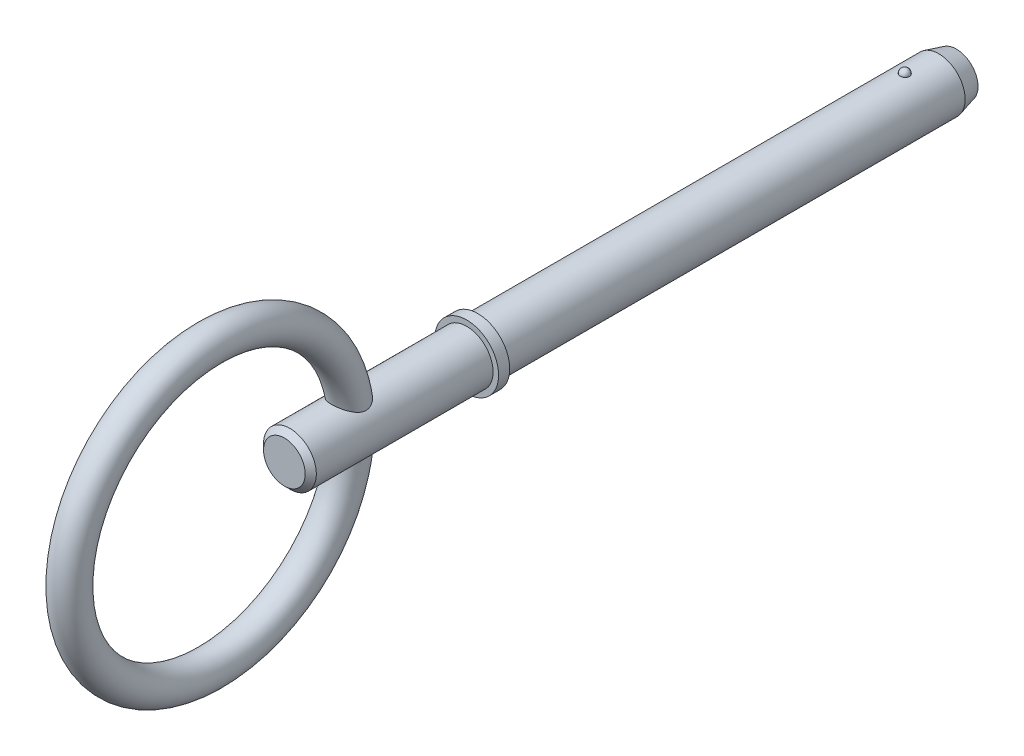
from build123d import *

# Parameters (mm, degrees)
SKETCH2_R           = 2.38
BOSS_EXTRUDE1_DEPTH = 38.1
BOSS_EXTRUDE2_START = 5.08
SKETCH3_R           = 2.38
BOSS_EXTRUDE2_DEPTH = 5.08
CHAMFER1_SIZE       = 1.586
CHAMFER1_SIZE2      = 0.424967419
SKETCH20_W          = 1
SKETCH20_H          = 2.88
SKETCH21_R          = 2.38
BOSS_EXTRUDE3_DEPTH = 17.45
CHAMFER2_SIZE       = 0.5
SKETCH24_R          = 1.5


with BuildPart() as part:
    # Sketch2 → Boss-Extrude1 (new body)
    with BuildSketch(Plane.XY):
        with Locations(Location((0, 0, 0), (0, 0, 180))):
            Circle(SKETCH2_R)
    extrude(amount=BOSS_EXTRUDE1_DEPTH)

    # Sketch3 → Boss-Extrude2 (add)
    with BuildSketch(Plane(origin=(0, 0, 0), x_dir=(-1, 0, 0), z_dir=(0, 0, -1)).offset(BOSS_EXTRUDE2_START)):
        Circle(SKETCH3_R)
    extrude(amount=-BOSS_EXTRUDE2_DEPTH)

    # Chamfer1
    chamfer1_edges = [part.edges().sort_by_distance(p)[0] for p in [
        (2.38, 0, -5.08),
    ]]
    chamfer1_side = [part.faces().sort_by_distance(p)[0] for p in [
        (2.38, 0, 16.51),
    ]]
    chamfer(chamfer1_edges, length=CHAMFER1_SIZE, length2=CHAMFER1_SIZE2, reference=chamfer1_side[0])

    # Sketch18 → Revolve1 (revolve)
    with BuildSketch(Plane(origin=(0, 0, 0), x_dir=(0, 0, -1), z_dir=(1, 0, 0))):
        with BuildLine():
            Line((0.42, 2.8), (0.42, 1.96))
            ThreePointArc((0.42, 1.96), (0, 2.38), (0.42, 2.8))
        make_face()
    revolve(axis=Axis((0, 2.8, -0.42), (0, -1, 0)))

    # Sketch20 → Revolve2 (revolve)
    with BuildSketch(Plane(origin=(0, 0, 0), x_dir=(0, 0, -1), z_dir=(1, 0, 0)), mode=Mode.PRIVATE) as revolve2_sk:
        with Locations((-38.6, 1.44)):
            Rectangle(SKETCH20_W, SKETCH20_H)
    revolve(revolve2_sk.sketch.rotate(Axis((0, 0, 33.728787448), (0, 0, 1)), 90), axis=Axis((0, 0, 33.728787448), (0, 0, 1)))

    # Sketch21 → Boss-Extrude3 (add)
    with BuildSketch(Plane(origin=(0, 0, 38.1), x_dir=(-1, 0, 0), z_dir=(0, 0, -1))):
        Circle(SKETCH21_R)
    extrude(amount=-BOSS_EXTRUDE3_DEPTH)

    # Chamfer2
    chamfer2_edges = [part.edges().sort_by_distance(p)[0] for p in [
        (2.38, 0, 55.55),
    ]]
    chamfer(chamfer2_edges, length=CHAMFER2_SIZE)

    # Sweep1: sweep along a path in Sketch23
    with BuildLine(Plane(origin=(0, 0, 0), x_dir=(0, 0, -1), z_dir=(1, 0, 0))) as sweep1_path:
        CenterArc((-62.25, 0), 12.7, 0, 360)
    # Sketch24 → Sweep1 (sweep)
    with BuildSketch(Plane(origin=(0, 0, 0), x_dir=(1, 0, 0), z_dir=(0, 1, 0))):
        with Locations((0, -49.55)):
            Circle(SKETCH24_R)
    sweep(path=sweep1_path.line)


solid = part.part
